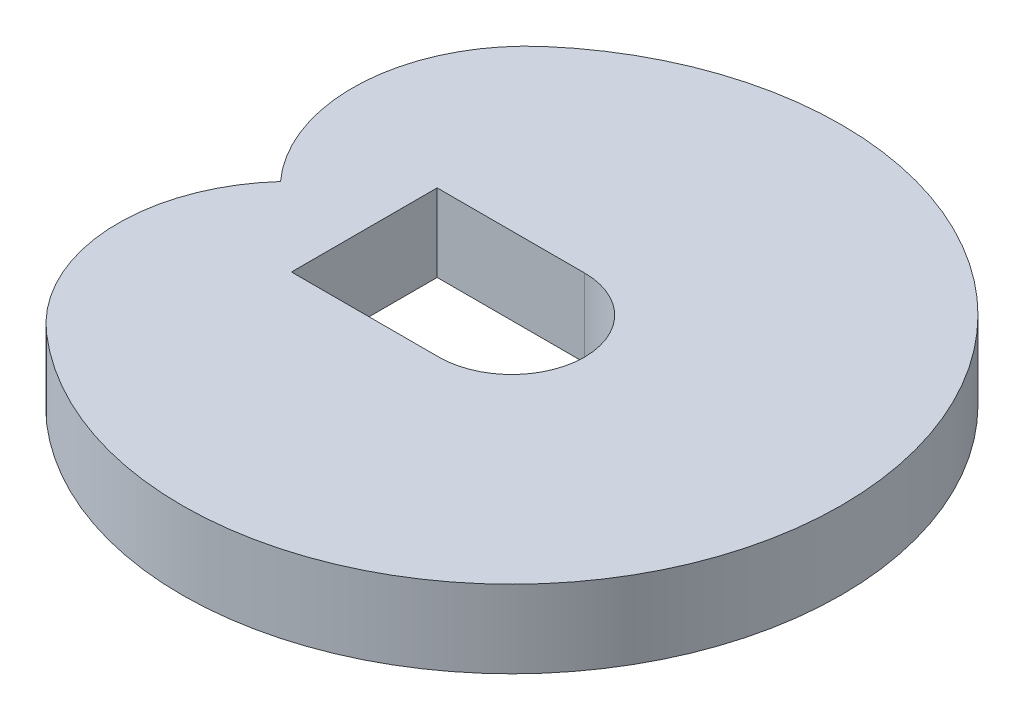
ISO-10303-21;
HEADER;
FILE_DESCRIPTION(('STEP AP214'),'2;1');
FILE_NAME('part.step','',(''),(''),'','','');
FILE_SCHEMA(('AUTOMOTIVE_DESIGN { 1 0 10303 214 1 1 1 1 }'));
ENDSEC;
DATA;
#1=APPLICATION_CONTEXT('core data for automotive mechanical design processes');
#2=APPLICATION_PROTOCOL_DEFINITION('international standard','automotive_design',2000,#1);
#3=PRODUCT_CONTEXT('',#1,'mechanical');
#4=PRODUCT('Part','Part','',(#3));
#5=PRODUCT_RELATED_PRODUCT_CATEGORY('part','',(#4));
#6=PRODUCT_DEFINITION_FORMATION('','',#4);
#7=PRODUCT_DEFINITION_CONTEXT('part definition',#1,'design');
#8=PRODUCT_DEFINITION('design','',#6,#7);
#9=PRODUCT_DEFINITION_SHAPE('','',#8);
#10=(LENGTH_UNIT() NAMED_UNIT(*) SI_UNIT(.MILLI.,.METRE.));
#11=(NAMED_UNIT(*) PLANE_ANGLE_UNIT() SI_UNIT($,.RADIAN.));
#12=(NAMED_UNIT(*) SI_UNIT($,.STERADIAN.) SOLID_ANGLE_UNIT());
#13=UNCERTAINTY_MEASURE_WITH_UNIT(LENGTH_MEASURE(1.E-05),#10,'distance_accuracy_value','');
#14=(GEOMETRIC_REPRESENTATION_CONTEXT(3) GLOBAL_UNCERTAINTY_ASSIGNED_CONTEXT((#13)) GLOBAL_UNIT_ASSIGNED_CONTEXT((#10,
#11,#12)) REPRESENTATION_CONTEXT('',''));
#15=CARTESIAN_POINT('',(0.,0.,0.));
#16=DIRECTION('',(0.,0.,1.));
#17=DIRECTION('',(1.,0.,0.));
#18=AXIS2_PLACEMENT_3D('',#15,#16,#17);
#19=CARTESIAN_POINT('',(-105.936690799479,107.899198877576,0.));
#20=DIRECTION('',(0.,-1.,0.));
#21=DIRECTION('',(0.,0.,-1.));
#22=AXIS2_PLACEMENT_3D('',#19,#20,#21);
#23=CYLINDRICAL_SURFACE('',#22,850.);
#24=CARTESIAN_POINT('',(-105.936690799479,-92.1008011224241,0.));
#25=DIRECTION('',(0.,1.,0.));
#26=DIRECTION('',(0.,0.,1.));
#27=AXIS2_PLACEMENT_3D('',#24,#25,#26);
#28=CIRCLE('',#27,850.);
#29=CARTESIAN_POINT('',(-663.58686544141,-92.1008011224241,641.503143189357));
#30=VERTEX_POINT('',#29);
#31=CARTESIAN_POINT('',(-663.586865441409,-92.1008011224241,-641.503143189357));
#32=VERTEX_POINT('',#31);
#33=EDGE_CURVE('E95',#30,#32,#28,.T.);
#34=ORIENTED_EDGE('',*,*,#33,.T.);
#35=DIRECTION('',(0.,-1.,0.));
#36=VECTOR('',#35,1.);
#37=CARTESIAN_POINT('',(-663.586865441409,107.899198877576,-641.503143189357));
#38=LINE('',#37,#36);
#39=CARTESIAN_POINT('',(-663.586865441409,107.899198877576,-641.503143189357));
#40=VERTEX_POINT('',#39);
#41=EDGE_CURVE('E10',#40,#32,#38,.T.);
#42=ORIENTED_EDGE('',*,*,#41,.F.);
#43=CARTESIAN_POINT('',(-105.936690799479,107.899198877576,0.));
#44=DIRECTION('',(0.,1.,0.));
#45=DIRECTION('',(0.,0.,1.));
#46=AXIS2_PLACEMENT_3D('',#43,#44,#45);
#47=CIRCLE('',#46,850.);
#48=CARTESIAN_POINT('',(-663.58686544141,107.899198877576,641.503143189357));
#49=VERTEX_POINT('',#48);
#50=EDGE_CURVE('E87',#49,#40,#47,.T.);
#51=ORIENTED_EDGE('',*,*,#50,.F.);
#52=DIRECTION('',(0.,-1.,0.));
#53=VECTOR('',#52,1.);
#54=CARTESIAN_POINT('',(-663.58686544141,107.899198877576,641.503143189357));
#55=LINE('',#54,#53);
#56=EDGE_CURVE('E96',#49,#30,#55,.T.);
#57=ORIENTED_EDGE('',*,*,#56,.T.);
#58=EDGE_LOOP('',(#34,#42,#51,#57));
#59=FACE_BOUND('',#58,.T.);
#60=ADVANCED_FACE('F16',(#59),#23,.T.);
#61=CARTESIAN_POINT('',(-368.360302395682,107.899198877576,-301.883832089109));
#62=DIRECTION('',(0.,-1.,0.));
#63=DIRECTION('',(0.,0.,-1.));
#64=AXIS2_PLACEMENT_3D('',#61,#62,#63);
#65=CYLINDRICAL_SURFACE('',#64,450.);
#66=CARTESIAN_POINT('',(-368.360302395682,-92.1008011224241,-301.883832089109));
#67=DIRECTION('',(0.,1.,0.));
#68=DIRECTION('',(0.,0.,1.));
#69=AXIS2_PLACEMENT_3D('',#66,#67,#68);
#70=CIRCLE('',#69,450.);
#71=CARTESIAN_POINT('',(-702.075977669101,-92.1008011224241,-1.11022302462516E-13));
#72=VERTEX_POINT('',#71);
#73=EDGE_CURVE('E59',#32,#72,#70,.T.);
#74=ORIENTED_EDGE('',*,*,#73,.T.);
#75=DIRECTION('',(0.,-1.,0.));
#76=VECTOR('',#75,1.);
#77=CARTESIAN_POINT('',(-702.075977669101,107.899198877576,-1.11022302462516E-13));
#78=LINE('',#77,#76);
#79=CARTESIAN_POINT('',(-702.075977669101,107.899198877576,-1.11022302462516E-13));
#80=VERTEX_POINT('',#79);
#81=EDGE_CURVE('E26',#80,#72,#78,.T.);
#82=ORIENTED_EDGE('',*,*,#81,.F.);
#83=CARTESIAN_POINT('',(-368.360302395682,107.899198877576,-301.883832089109));
#84=DIRECTION('',(0.,1.,0.));
#85=DIRECTION('',(0.,0.,1.));
#86=AXIS2_PLACEMENT_3D('',#83,#84,#85);
#87=CIRCLE('',#86,450.);
#88=EDGE_CURVE('E83',#40,#80,#87,.T.);
#89=ORIENTED_EDGE('',*,*,#88,.F.);
#90=ORIENTED_EDGE('',*,*,#41,.T.);
#91=EDGE_LOOP('',(#74,#82,#89,#90));
#92=FACE_BOUND('',#91,.T.);
#93=ADVANCED_FACE('F84',(#92),#65,.T.);
#94=CARTESIAN_POINT('',(-105.936690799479,107.899198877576,0.));
#95=DIRECTION('',(0.,-1.,0.));
#96=DIRECTION('',(0.,0.,-1.));
#97=AXIS2_PLACEMENT_3D('',#94,#95,#96);
#98=CYLINDRICAL_SURFACE('',#97,187.788625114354);
#99=CARTESIAN_POINT('',(-105.936690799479,-92.1008011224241,0.));
#100=DIRECTION('',(0.,1.,0.));
#101=DIRECTION('',(0.,0.,1.));
#102=AXIS2_PLACEMENT_3D('',#99,#100,#101);
#103=CIRCLE('',#102,187.788625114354);
#104=CARTESIAN_POINT('',(-105.936690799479,-92.1008011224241,187.788625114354));
#105=VERTEX_POINT('',#104);
#106=CARTESIAN_POINT('',(-105.936690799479,-92.1008011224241,-187.788625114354));
#107=VERTEX_POINT('',#106);
#108=EDGE_CURVE('E127',#105,#107,#103,.T.);
#109=ORIENTED_EDGE('',*,*,#108,.F.);
#110=DIRECTION('',(0.,-1.,0.));
#111=VECTOR('',#110,1.);
#112=CARTESIAN_POINT('',(-105.936690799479,107.899198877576,187.788625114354));
#113=LINE('',#112,#111);
#114=CARTESIAN_POINT('',(-105.936690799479,107.899198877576,187.788625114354));
#115=VERTEX_POINT('',#114);
#116=EDGE_CURVE('E20',#115,#105,#113,.T.);
#117=ORIENTED_EDGE('',*,*,#116,.F.);
#118=CARTESIAN_POINT('',(-105.936690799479,107.899198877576,0.));
#119=DIRECTION('',(0.,1.,0.));
#120=DIRECTION('',(0.,0.,1.));
#121=AXIS2_PLACEMENT_3D('',#118,#119,#120);
#122=CIRCLE('',#121,187.788625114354);
#123=CARTESIAN_POINT('',(-105.936690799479,107.899198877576,-187.788625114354));
#124=VERTEX_POINT('',#123);
#125=EDGE_CURVE('E107',#115,#124,#122,.T.);
#126=ORIENTED_EDGE('',*,*,#125,.T.);
#127=DIRECTION('',(0.,-1.,0.));
#128=VECTOR('',#127,1.);
#129=CARTESIAN_POINT('',(-105.936690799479,107.899198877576,-187.788625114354));
#130=LINE('',#129,#128);
#131=EDGE_CURVE('E110',#124,#107,#130,.T.);
#132=ORIENTED_EDGE('',*,*,#131,.T.);
#133=EDGE_LOOP('',(#109,#117,#126,#132));
#134=FACE_BOUND('',#133,.T.);
#135=ADVANCED_FACE('F18',(#134),#98,.F.);
#136=CARTESIAN_POINT('',(-105.936690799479,107.899198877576,187.788625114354));
#137=DIRECTION('',(0.,0.,-1.));
#138=DIRECTION('',(-1.,0.,0.));
#139=AXIS2_PLACEMENT_3D('',#136,#137,#138);
#140=PLANE('',#139);
#141=DIRECTION('',(1.,0.,0.));
#142=VECTOR('',#141,1.);
#143=CARTESIAN_POINT('',(-105.936690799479,-92.1008011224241,187.788625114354));
#144=LINE('',#143,#142);
#145=CARTESIAN_POINT('',(-485.936690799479,-92.1008011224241,187.788625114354));
#146=VERTEX_POINT('',#145);
#147=EDGE_CURVE('E122',#146,#105,#144,.T.);
#148=ORIENTED_EDGE('',*,*,#147,.F.);
#149=DIRECTION('',(0.,-1.,0.));
#150=VECTOR('',#149,1.);
#151=CARTESIAN_POINT('',(-485.936690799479,107.899198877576,187.788625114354));
#152=LINE('',#151,#150);
#153=CARTESIAN_POINT('',(-485.936690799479,107.899198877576,187.788625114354));
#154=VERTEX_POINT('',#153);
#155=EDGE_CURVE('E113',#154,#146,#152,.T.);
#156=ORIENTED_EDGE('',*,*,#155,.F.);
#157=DIRECTION('',(1.,0.,0.));
#158=VECTOR('',#157,1.);
#159=CARTESIAN_POINT('',(-105.936690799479,107.899198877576,187.788625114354));
#160=LINE('',#159,#158);
#161=EDGE_CURVE('E125',#154,#115,#160,.T.);
#162=ORIENTED_EDGE('',*,*,#161,.T.);
#163=ORIENTED_EDGE('',*,*,#116,.T.);
#164=EDGE_LOOP('',(#148,#156,#162,#163));
#165=FACE_BOUND('',#164,.T.);
#166=ADVANCED_FACE('F120',(#165),#140,.T.);
#167=CARTESIAN_POINT('',(-485.936690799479,107.899198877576,0.));
#168=DIRECTION('',(1.,0.,0.));
#169=DIRECTION('',(0.,0.,-1.));
#170=AXIS2_PLACEMENT_3D('',#167,#168,#169);
#171=PLANE('',#170);
#172=DIRECTION('',(0.,0.,1.));
#173=VECTOR('',#172,1.);
#174=CARTESIAN_POINT('',(-485.936690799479,-92.1008011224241,0.));
#175=LINE('',#174,#173);
#176=CARTESIAN_POINT('',(-485.936690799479,-92.1008011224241,-187.788625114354));
#177=VERTEX_POINT('',#176);
#178=EDGE_CURVE('E102',#177,#146,#175,.T.);
#179=ORIENTED_EDGE('',*,*,#178,.F.);
#180=DIRECTION('',(0.,-1.,0.));
#181=VECTOR('',#180,1.);
#182=CARTESIAN_POINT('',(-485.936690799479,107.899198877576,-187.788625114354));
#183=LINE('',#182,#181);
#184=CARTESIAN_POINT('',(-485.936690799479,107.899198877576,-187.788625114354));
#185=VERTEX_POINT('',#184);
#186=EDGE_CURVE('E112',#185,#177,#183,.T.);
#187=ORIENTED_EDGE('',*,*,#186,.F.);
#188=DIRECTION('',(0.,0.,1.));
#189=VECTOR('',#188,1.);
#190=CARTESIAN_POINT('',(-485.936690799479,107.899198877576,0.));
#191=LINE('',#190,#189);
#192=EDGE_CURVE('E137',#185,#154,#191,.T.);
#193=ORIENTED_EDGE('',*,*,#192,.T.);
#194=ORIENTED_EDGE('',*,*,#155,.T.);
#195=EDGE_LOOP('',(#179,#187,#193,#194));
#196=FACE_BOUND('',#195,.T.);
#197=ADVANCED_FACE('F145',(#196),#171,.T.);
#198=CARTESIAN_POINT('',(-105.936690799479,107.899198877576,-187.788625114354));
#199=DIRECTION('',(0.,0.,-1.));
#200=DIRECTION('',(-1.,0.,0.));
#201=AXIS2_PLACEMENT_3D('',#198,#199,#200);
#202=PLANE('',#201);
#203=DIRECTION('',(1.,0.,0.));
#204=VECTOR('',#203,1.);
#205=CARTESIAN_POINT('',(-105.936690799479,-92.1008011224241,-187.788625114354));
#206=LINE('',#205,#204);
#207=EDGE_CURVE('E98',#177,#107,#206,.T.);
#208=ORIENTED_EDGE('',*,*,#207,.T.);
#209=ORIENTED_EDGE('',*,*,#131,.F.);
#210=DIRECTION('',(1.,0.,0.));
#211=VECTOR('',#210,1.);
#212=CARTESIAN_POINT('',(-105.936690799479,107.899198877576,-187.788625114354));
#213=LINE('',#212,#211);
#214=EDGE_CURVE('E92',#185,#124,#213,.T.);
#215=ORIENTED_EDGE('',*,*,#214,.F.);
#216=ORIENTED_EDGE('',*,*,#186,.T.);
#217=EDGE_LOOP('',(#208,#209,#215,#216));
#218=FACE_BOUND('',#217,.T.);
#219=ADVANCED_FACE('F144',(#218),#202,.F.);
#220=CARTESIAN_POINT('',(-368.360302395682,107.899198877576,301.883832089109));
#221=DIRECTION('',(0.,-1.,0.));
#222=DIRECTION('',(0.,0.,-1.));
#223=AXIS2_PLACEMENT_3D('',#220,#221,#222);
#224=CYLINDRICAL_SURFACE('',#223,450.);
#225=CARTESIAN_POINT('',(-368.360302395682,-92.1008011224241,301.883832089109));
#226=DIRECTION('',(0.,1.,0.));
#227=DIRECTION('',(0.,0.,1.));
#228=AXIS2_PLACEMENT_3D('',#225,#226,#227);
#229=CIRCLE('',#228,450.);
#230=EDGE_CURVE('E65',#72,#30,#229,.T.);
#231=ORIENTED_EDGE('',*,*,#230,.T.);
#232=ORIENTED_EDGE('',*,*,#56,.F.);
#233=CARTESIAN_POINT('',(-368.360302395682,107.899198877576,301.883832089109));
#234=DIRECTION('',(0.,1.,0.));
#235=DIRECTION('',(0.,0.,1.));
#236=AXIS2_PLACEMENT_3D('',#233,#234,#235);
#237=CIRCLE('',#236,450.);
#238=EDGE_CURVE('E35',#80,#49,#237,.T.);
#239=ORIENTED_EDGE('',*,*,#238,.F.);
#240=ORIENTED_EDGE('',*,*,#81,.T.);
#241=EDGE_LOOP('',(#231,#232,#239,#240));
#242=FACE_BOUND('',#241,.T.);
#243=ADVANCED_FACE('F153',(#242),#224,.T.);
#244=CARTESIAN_POINT('',(-105.936690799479,107.899198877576,0.));
#245=DIRECTION('',(0.,1.,0.));
#246=DIRECTION('',(0.,0.,1.));
#247=AXIS2_PLACEMENT_3D('',#244,#245,#246);
#248=PLANE('',#247);
#249=ORIENTED_EDGE('',*,*,#125,.F.);
#250=ORIENTED_EDGE('',*,*,#161,.F.);
#251=ORIENTED_EDGE('',*,*,#192,.F.);
#252=ORIENTED_EDGE('',*,*,#214,.T.);
#253=EDGE_LOOP('',(#249,#250,#251,#252));
#254=FACE_BOUND('',#253,.T.);
#255=ORIENTED_EDGE('',*,*,#50,.T.);
#256=ORIENTED_EDGE('',*,*,#88,.T.);
#257=ORIENTED_EDGE('',*,*,#238,.T.);
#258=EDGE_LOOP('',(#255,#256,#257));
#259=FACE_BOUND('',#258,.T.);
#260=ADVANCED_FACE('F90',(#254,#259),#248,.T.);
#261=CARTESIAN_POINT('',(-105.936690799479,-92.1008011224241,0.));
#262=DIRECTION('',(0.,1.,0.));
#263=DIRECTION('',(0.,0.,1.));
#264=AXIS2_PLACEMENT_3D('',#261,#262,#263);
#265=PLANE('',#264);
#266=ORIENTED_EDGE('',*,*,#108,.T.);
#267=ORIENTED_EDGE('',*,*,#207,.F.);
#268=ORIENTED_EDGE('',*,*,#178,.T.);
#269=ORIENTED_EDGE('',*,*,#147,.T.);
#270=EDGE_LOOP('',(#266,#267,#268,#269));
#271=FACE_BOUND('',#270,.T.);
#272=ORIENTED_EDGE('',*,*,#33,.F.);
#273=ORIENTED_EDGE('',*,*,#230,.F.);
#274=ORIENTED_EDGE('',*,*,#73,.F.);
#275=EDGE_LOOP('',(#272,#273,#274));
#276=FACE_BOUND('',#275,.T.);
#277=ADVANCED_FACE('F132',(#271,#276),#265,.F.);
#278=CLOSED_SHELL('',(#60,#93,#135,#166,#197,#219,#243,#260,#277));
#279=MANIFOLD_SOLID_BREP('B1',#278);
#280=ADVANCED_BREP_SHAPE_REPRESENTATION('',(#18,#279),#14);
#281=SHAPE_DEFINITION_REPRESENTATION(#9,#280);
ENDSEC;
END-ISO-10303-21;
